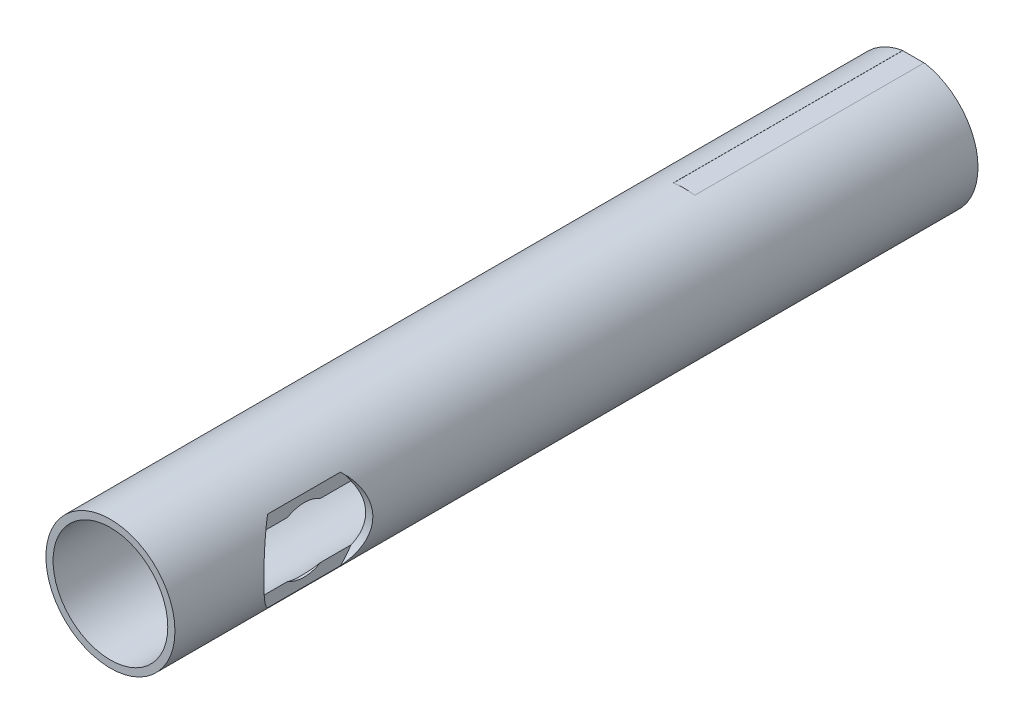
from build123d import *

# Parameters (mm, degrees)
SKETCH1_R           = 28.575
SKETCH1_R_2         = 25.4
BOSS_EXTRUDE1_DEPTH = 355.6
CUT_EXTRUDE1_START  = 22.225
SKETCH2_R           = 24.13
CUT_EXTRUDE1_DEPTH  = 25.4
SKETCH3_R           = 14.2875
CUT_EXTRUDE2_DEPTH  = 6.35
CUT_EXTRUDE3_START  = -28.067
SKETCH4_W           = 9.4996
SKETCH4_H           = 101.6
CUT_EXTRUDE3_DEPTH  = 330.821839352
CUT_EXTRUDE5_START  = -56.1848
SKETCH6_W           = 9.4996
SKETCH6_H           = 101.6
CUT_EXTRUDE5_DEPTH  = 2.54


with BuildPart() as part:
    # Sketch1 → Boss-Extrude1 (new body)
    with BuildSketch(Plane.XY):
        Circle(SKETCH1_R)
        Circle(SKETCH1_R_2, mode=Mode.SUBTRACT)
    extrude(amount=-BOSS_EXTRUDE1_DEPTH)

    # Sketch2 → Cut-Extrude1 (cut)
    with BuildSketch(Plane(origin=(0, 0, 0), x_dir=(0, 0, -1), z_dir=(1, 0, 0)).offset(CUT_EXTRUDE1_START)):
        with Locations((63.5, 0)):
            Circle(SKETCH2_R)
    extrude(amount=CUT_EXTRUDE1_DEPTH, mode=Mode.SUBTRACT)

    # Sketch3 → Cut-Extrude2 (cut)
    with BuildSketch(Plane(origin=(22.225, 0, 0), x_dir=(0, 0, -1), z_dir=(1, 0, 0))):
        with Locations((63.5, 0)):
            Circle(SKETCH3_R)
    extrude(amount=-CUT_EXTRUDE2_DEPTH, mode=Mode.SUBTRACT)

    # Sketch4 → Cut-Extrude3 (cut, through all)
    with BuildSketch(Plane(origin=(0, 0, 0), x_dir=(1, 0, 0), z_dir=(0, 1, 0)).offset(CUT_EXTRUDE3_START)):
        with Locations((0, 304.8)):
            Rectangle(SKETCH4_W, SKETCH4_H)
    extrude(amount=-CUT_EXTRUDE3_DEPTH, mode=Mode.SUBTRACT)

    # Sketch6 → Cut-Extrude5 (cut)
    with BuildSketch(Plane.XZ.offset(28.067).offset(CUT_EXTRUDE5_START)):
        with Locations((0, -304.8)):
            Rectangle(SKETCH6_W, SKETCH6_H)
    extrude(amount=-CUT_EXTRUDE5_DEPTH, mode=Mode.SUBTRACT)


solid = part.part
